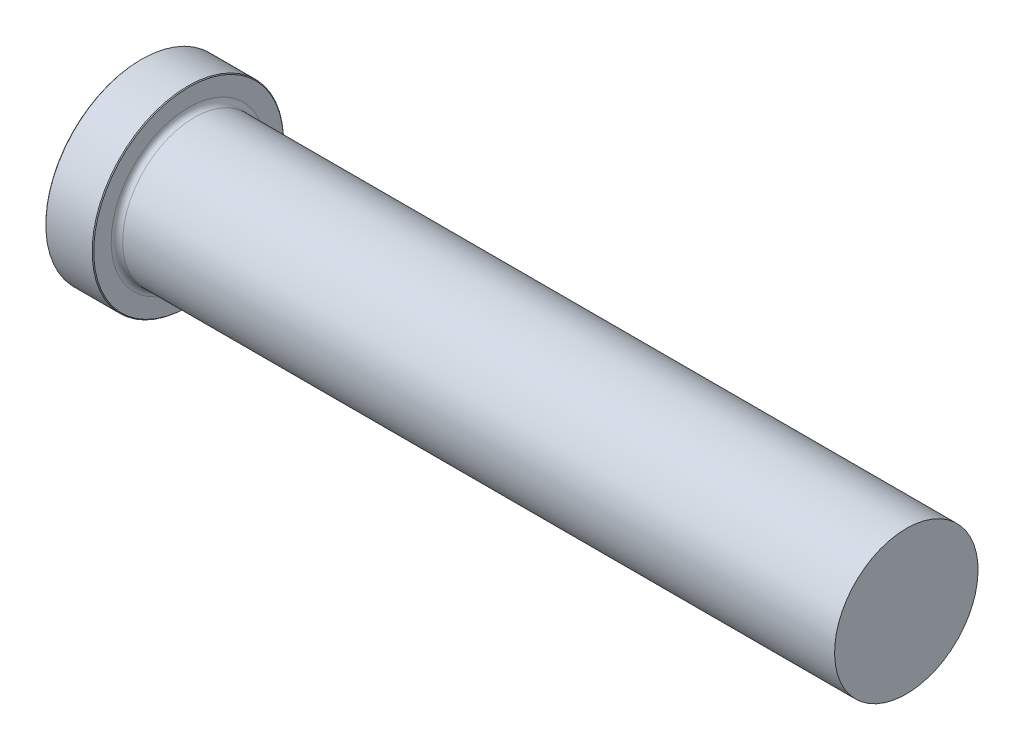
from build123d import *

# Parameters (mm, degrees)
CHAMFER1_SIZE = 0.1016


with BuildPart() as part:
    # Sketch1 → Revolve1 (revolve)
    with BuildSketch(Plane.XY):
        with BuildLine():
            Line((0, 0), (0, 12.7))
            Line((0, 12.7), (6.35, 12.7))
            Line((6.35, 12.7), (6.35, 10.28065))
            ThreePointArc((6.35, 10.28065), (6.573184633, 9.741834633), (7.112, 9.51865))
            Line((7.112, 9.51865), (101.6, 9.51865))
            Line((101.6, 9.51865), (101.6, 0))
            Line((101.6, 0), (0, 0))
        make_face()
    revolve(axis=Axis((101.6, 0, 0), (-1, 0, 0)))

    # Chamfer1
    chamfer1_edges = [part.edges().sort_by_distance(p)[0] for p in [
        (0, -12.7, 0),
        (6.35, -12.7, 0),
    ]]
    chamfer(chamfer1_edges, length=CHAMFER1_SIZE)


solid = part.part
